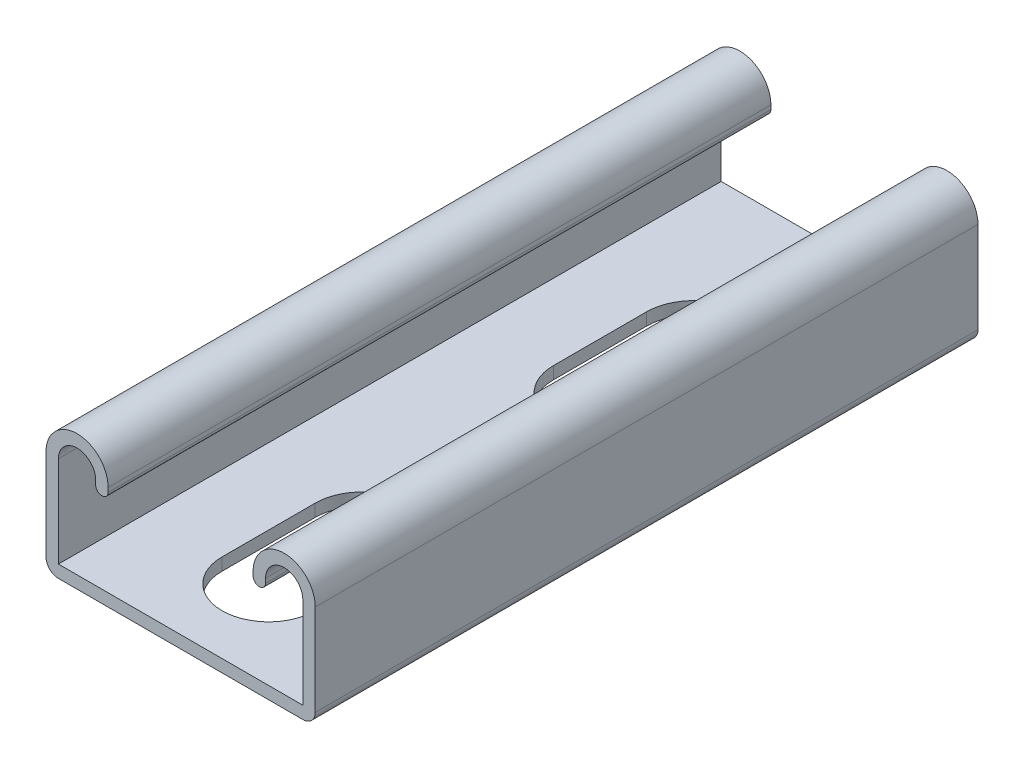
ISO-10303-21;
HEADER;
FILE_DESCRIPTION(('STEP AP214'),'2;1');
FILE_NAME('part.step','',(''),(''),'','','');
FILE_SCHEMA(('AUTOMOTIVE_DESIGN { 1 0 10303 214 1 1 1 1 }'));
ENDSEC;
DATA;
#1=APPLICATION_CONTEXT('core data for automotive mechanical design processes');
#2=APPLICATION_PROTOCOL_DEFINITION('international standard','automotive_design',2000,#1);
#3=PRODUCT_CONTEXT('',#1,'mechanical');
#4=PRODUCT('Part','Part','',(#3));
#5=PRODUCT_RELATED_PRODUCT_CATEGORY('part','',(#4));
#6=PRODUCT_DEFINITION_FORMATION('','',#4);
#7=PRODUCT_DEFINITION_CONTEXT('part definition',#1,'design');
#8=PRODUCT_DEFINITION('design','',#6,#7);
#9=PRODUCT_DEFINITION_SHAPE('','',#8);
#10=(LENGTH_UNIT() NAMED_UNIT(*) SI_UNIT(.MILLI.,.METRE.));
#11=(NAMED_UNIT(*) PLANE_ANGLE_UNIT() SI_UNIT($,.RADIAN.));
#12=(NAMED_UNIT(*) SI_UNIT($,.STERADIAN.) SOLID_ANGLE_UNIT());
#13=UNCERTAINTY_MEASURE_WITH_UNIT(LENGTH_MEASURE(1.E-05),#10,'distance_accuracy_value','');
#14=(GEOMETRIC_REPRESENTATION_CONTEXT(3) GLOBAL_UNCERTAINTY_ASSIGNED_CONTEXT((#13)) GLOBAL_UNIT_ASSIGNED_CONTEXT((#10,
#11,#12)) REPRESENTATION_CONTEXT('',''));
#15=CARTESIAN_POINT('',(0.,0.,0.));
#16=DIRECTION('',(0.,0.,1.));
#17=DIRECTION('',(1.,0.,0.));
#18=AXIS2_PLACEMENT_3D('',#15,#16,#17);
#19=CARTESIAN_POINT('',(-15.875,7.4295,101.6));
#20=DIRECTION('',(0.,0.,-1.));
#21=DIRECTION('',(-1.,0.,0.));
#22=AXIS2_PLACEMENT_3D('',#19,#20,#21);
#23=CYLINDRICAL_SURFACE('',#22,4.7625);
#24=CARTESIAN_POINT('',(-15.875,7.4295,0.));
#25=DIRECTION('',(0.,0.,1.));
#26=DIRECTION('',(-1.,0.,0.));
#27=AXIS2_PLACEMENT_3D('',#24,#25,#26);
#28=CIRCLE('',#27,4.7625);
#29=CARTESIAN_POINT('',(-11.1125,7.4295,0.));
#30=VERTEX_POINT('',#29);
#31=CARTESIAN_POINT('',(-20.6375,7.4295,0.));
#32=VERTEX_POINT('',#31);
#33=EDGE_CURVE('E254',#30,#32,#28,.T.);
#34=ORIENTED_EDGE('',*,*,#33,.T.);
#35=DIRECTION('',(0.,0.,-1.));
#36=VECTOR('',#35,1.);
#37=CARTESIAN_POINT('',(-20.6375,7.4295,101.6));
#38=LINE('',#37,#36);
#39=CARTESIAN_POINT('',(-20.6375,7.4295,101.6));
#40=VERTEX_POINT('',#39);
#41=EDGE_CURVE('E385',#40,#32,#38,.T.);
#42=ORIENTED_EDGE('',*,*,#41,.F.);
#43=CARTESIAN_POINT('',(-15.875,7.4295,101.6));
#44=DIRECTION('',(0.,0.,1.));
#45=DIRECTION('',(-1.,0.,0.));
#46=AXIS2_PLACEMENT_3D('',#43,#44,#45);
#47=CIRCLE('',#46,4.7625);
#48=CARTESIAN_POINT('',(-11.1125,7.4295,101.6));
#49=VERTEX_POINT('',#48);
#50=EDGE_CURVE('E261',#49,#40,#47,.T.);
#51=ORIENTED_EDGE('',*,*,#50,.F.);
#52=DIRECTION('',(0.,0.,-1.));
#53=VECTOR('',#52,1.);
#54=CARTESIAN_POINT('',(-11.1125,7.4295,101.6));
#55=LINE('',#54,#53);
#56=EDGE_CURVE('E299',#49,#30,#55,.T.);
#57=ORIENTED_EDGE('',*,*,#56,.T.);
#58=EDGE_LOOP('',(#34,#42,#51,#57));
#59=FACE_BOUND('',#58,.T.);
#60=ADVANCED_FACE('F33',(#59),#23,.T.);
#61=CARTESIAN_POINT('',(-20.6375,7.4295,101.6));
#62=DIRECTION('',(1.,0.,0.));
#63=DIRECTION('',(0.,0.,-1.));
#64=AXIS2_PLACEMENT_3D('',#61,#62,#63);
#65=PLANE('',#64);
#66=DIRECTION('',(0.,-1.,0.));
#67=VECTOR('',#66,1.);
#68=CARTESIAN_POINT('',(-20.6375,7.4295,0.));
#69=LINE('',#68,#67);
#70=CARTESIAN_POINT('',(-20.6375,-6.5532,0.));
#71=VERTEX_POINT('',#70);
#72=EDGE_CURVE('E302',#32,#71,#69,.T.);
#73=ORIENTED_EDGE('',*,*,#72,.T.);
#74=DIRECTION('',(0.,0.,-1.));
#75=VECTOR('',#74,1.);
#76=CARTESIAN_POINT('',(-20.6375,-6.5532,101.6));
#77=LINE('',#76,#75);
#78=CARTESIAN_POINT('',(-20.6375,-6.5532,101.6));
#79=VERTEX_POINT('',#78);
#80=EDGE_CURVE('E382',#79,#71,#77,.T.);
#81=ORIENTED_EDGE('',*,*,#80,.F.);
#82=DIRECTION('',(0.,-1.,0.));
#83=VECTOR('',#82,1.);
#84=CARTESIAN_POINT('',(-20.6375,7.4295,101.6));
#85=LINE('',#84,#83);
#86=EDGE_CURVE('E264',#40,#79,#85,.T.);
#87=ORIENTED_EDGE('',*,*,#86,.F.);
#88=ORIENTED_EDGE('',*,*,#41,.T.);
#89=EDGE_LOOP('',(#73,#81,#87,#88));
#90=FACE_BOUND('',#89,.T.);
#91=ADVANCED_FACE('F426',(#90),#65,.F.);
#92=CARTESIAN_POINT('',(-18.7325,-6.5532,101.6));
#93=DIRECTION('',(0.,0.,-1.));
#94=DIRECTION('',(-1.,0.,0.));
#95=AXIS2_PLACEMENT_3D('',#92,#93,#94);
#96=CYLINDRICAL_SURFACE('',#95,1.905);
#97=CARTESIAN_POINT('',(-18.7325,-6.5532,0.));
#98=DIRECTION('',(0.,0.,1.));
#99=DIRECTION('',(-1.,0.,0.));
#100=AXIS2_PLACEMENT_3D('',#97,#98,#99);
#101=CIRCLE('',#100,1.905);
#102=CARTESIAN_POINT('',(-18.7325,-8.4582,0.));
#103=VERTEX_POINT('',#102);
#104=EDGE_CURVE('E304',#71,#103,#101,.T.);
#105=ORIENTED_EDGE('',*,*,#104,.T.);
#106=DIRECTION('',(0.,0.,-1.));
#107=VECTOR('',#106,1.);
#108=CARTESIAN_POINT('',(-18.7325,-8.4582,101.6));
#109=LINE('',#108,#107);
#110=CARTESIAN_POINT('',(-18.7325,-8.4582,101.6));
#111=VERTEX_POINT('',#110);
#112=EDGE_CURVE('E379',#111,#103,#109,.T.);
#113=ORIENTED_EDGE('',*,*,#112,.F.);
#114=CARTESIAN_POINT('',(-18.7325,-6.5532,101.6));
#115=DIRECTION('',(0.,0.,1.));
#116=DIRECTION('',(-1.,0.,0.));
#117=AXIS2_PLACEMENT_3D('',#114,#115,#116);
#118=CIRCLE('',#117,1.905);
#119=EDGE_CURVE('E267',#79,#111,#118,.T.);
#120=ORIENTED_EDGE('',*,*,#119,.F.);
#121=ORIENTED_EDGE('',*,*,#80,.T.);
#122=EDGE_LOOP('',(#105,#113,#120,#121));
#123=FACE_BOUND('',#122,.T.);
#124=ADVANCED_FACE('F431',(#123),#96,.T.);
#125=CARTESIAN_POINT('',(-18.7325,-8.4582,101.6));
#126=DIRECTION('',(0.,1.,0.));
#127=DIRECTION('',(0.,0.,1.));
#128=AXIS2_PLACEMENT_3D('',#125,#126,#127);
#129=PLANE('',#128);
#130=DIRECTION('',(0.,0.,-1.));
#131=VECTOR('',#130,1.);
#132=CARTESIAN_POINT('',(-7.14375,-8.45820000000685,73.81875));
#133=LINE('',#132,#131);
#134=CARTESIAN_POINT('',(-7.14375,-8.4582,88.10625));
#135=VERTEX_POINT('',#134);
#136=CARTESIAN_POINT('',(-7.14375,-8.45820000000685,73.81875));
#137=VERTEX_POINT('',#136);
#138=EDGE_CURVE('E207',#135,#137,#133,.T.);
#139=ORIENTED_EDGE('',*,*,#138,.F.);
#140=CARTESIAN_POINT('',(0.,-8.45820000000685,88.10625));
#141=DIRECTION('',(0.,-1.,0.));
#142=DIRECTION('',(0.,0.,-1.));
#143=AXIS2_PLACEMENT_3D('',#140,#141,#142);
#144=CIRCLE('',#143,7.14375);
#145=CARTESIAN_POINT('',(7.14375,-8.45820000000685,88.10625));
#146=VERTEX_POINT('',#145);
#147=EDGE_CURVE('E47',#146,#135,#144,.T.);
#148=ORIENTED_EDGE('',*,*,#147,.F.);
#149=DIRECTION('',(0.,0.,1.));
#150=VECTOR('',#149,1.);
#151=CARTESIAN_POINT('',(7.14375,-8.45820000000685,88.10625));
#152=LINE('',#151,#150);
#153=CARTESIAN_POINT('',(7.14375,-8.45820000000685,73.81875));
#154=VERTEX_POINT('',#153);
#155=EDGE_CURVE('E223',#154,#146,#152,.T.);
#156=ORIENTED_EDGE('',*,*,#155,.F.);
#157=CARTESIAN_POINT('',(0.,-8.45820000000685,73.81875));
#158=DIRECTION('',(0.,-1.,0.));
#159=DIRECTION('',(0.,0.,-1.));
#160=AXIS2_PLACEMENT_3D('',#157,#158,#159);
#161=CIRCLE('',#160,7.14375);
#162=EDGE_CURVE('E217',#137,#154,#161,.T.);
#163=ORIENTED_EDGE('',*,*,#162,.F.);
#164=EDGE_LOOP('',(#139,#148,#156,#163));
#165=FACE_BOUND('',#164,.T.);
#166=DIRECTION('',(0.,0.,-1.));
#167=VECTOR('',#166,1.);
#168=CARTESIAN_POINT('',(-7.14375,-8.45820000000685,23.01875));
#169=LINE('',#168,#167);
#170=CARTESIAN_POINT('',(-7.14375,-8.4582,37.30625));
#171=VERTEX_POINT('',#170);
#172=CARTESIAN_POINT('',(-7.14375,-8.45820000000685,23.01875));
#173=VERTEX_POINT('',#172);
#174=EDGE_CURVE('E242',#171,#173,#169,.T.);
#175=ORIENTED_EDGE('',*,*,#174,.F.);
#176=CARTESIAN_POINT('',(0.,-8.45820000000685,37.30625));
#177=DIRECTION('',(0.,-1.,0.));
#178=DIRECTION('',(0.,0.,-1.));
#179=AXIS2_PLACEMENT_3D('',#176,#177,#178);
#180=CIRCLE('',#179,7.14375);
#181=CARTESIAN_POINT('',(7.14375,-8.45820000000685,37.30625));
#182=VERTEX_POINT('',#181);
#183=EDGE_CURVE('E240',#182,#171,#180,.T.);
#184=ORIENTED_EDGE('',*,*,#183,.F.);
#185=DIRECTION('',(0.,0.,1.));
#186=VECTOR('',#185,1.);
#187=CARTESIAN_POINT('',(7.14375,-8.45820000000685,37.30625));
#188=LINE('',#187,#186);
#189=CARTESIAN_POINT('',(7.14375,-8.45820000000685,23.01875));
#190=VERTEX_POINT('',#189);
#191=EDGE_CURVE('E248',#190,#182,#188,.T.);
#192=ORIENTED_EDGE('',*,*,#191,.F.);
#193=CARTESIAN_POINT('',(0.,-8.45820000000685,23.01875));
#194=DIRECTION('',(0.,-1.,0.));
#195=DIRECTION('',(0.,0.,-1.));
#196=AXIS2_PLACEMENT_3D('',#193,#194,#195);
#197=CIRCLE('',#196,7.14375);
#198=EDGE_CURVE('E245',#173,#190,#197,.T.);
#199=ORIENTED_EDGE('',*,*,#198,.F.);
#200=EDGE_LOOP('',(#175,#184,#192,#199));
#201=FACE_BOUND('',#200,.T.);
#202=DIRECTION('',(1.,0.,0.));
#203=VECTOR('',#202,1.);
#204=CARTESIAN_POINT('',(-18.7325,-8.4582,0.));
#205=LINE('',#204,#203);
#206=CARTESIAN_POINT('',(18.7325,-8.4582,0.));
#207=VERTEX_POINT('',#206);
#208=EDGE_CURVE('E306',#103,#207,#205,.T.);
#209=ORIENTED_EDGE('',*,*,#208,.T.);
#210=DIRECTION('',(0.,0.,-1.));
#211=VECTOR('',#210,1.);
#212=CARTESIAN_POINT('',(18.7325,-8.4582,101.6));
#213=LINE('',#212,#211);
#214=CARTESIAN_POINT('',(18.7325,-8.4582,101.6));
#215=VERTEX_POINT('',#214);
#216=EDGE_CURVE('E376',#215,#207,#213,.T.);
#217=ORIENTED_EDGE('',*,*,#216,.F.);
#218=DIRECTION('',(1.,0.,0.));
#219=VECTOR('',#218,1.);
#220=CARTESIAN_POINT('',(-18.7325,-8.4582,101.6));
#221=LINE('',#220,#219);
#222=EDGE_CURVE('E269',#111,#215,#221,.T.);
#223=ORIENTED_EDGE('',*,*,#222,.F.);
#224=ORIENTED_EDGE('',*,*,#112,.T.);
#225=EDGE_LOOP('',(#209,#217,#223,#224));
#226=FACE_BOUND('',#225,.T.);
#227=ADVANCED_FACE('F221',(#165,#201,#226),#129,.F.);
#228=CARTESIAN_POINT('',(18.7325,-6.5532,101.6));
#229=DIRECTION('',(0.,0.,-1.));
#230=DIRECTION('',(-1.,0.,0.));
#231=AXIS2_PLACEMENT_3D('',#228,#229,#230);
#232=CYLINDRICAL_SURFACE('',#231,1.905);
#233=CARTESIAN_POINT('',(18.7325,-6.5532,0.));
#234=DIRECTION('',(0.,0.,1.));
#235=DIRECTION('',(1.,0.,0.));
#236=AXIS2_PLACEMENT_3D('',#233,#234,#235);
#237=CIRCLE('',#236,1.905);
#238=CARTESIAN_POINT('',(20.6375,-6.5532,0.));
#239=VERTEX_POINT('',#238);
#240=EDGE_CURVE('E308',#207,#239,#237,.T.);
#241=ORIENTED_EDGE('',*,*,#240,.T.);
#242=DIRECTION('',(0.,0.,-1.));
#243=VECTOR('',#242,1.);
#244=CARTESIAN_POINT('',(20.6375,-6.5532,101.6));
#245=LINE('',#244,#243);
#246=CARTESIAN_POINT('',(20.6375,-6.5532,101.6));
#247=VERTEX_POINT('',#246);
#248=EDGE_CURVE('E373',#247,#239,#245,.T.);
#249=ORIENTED_EDGE('',*,*,#248,.F.);
#250=CARTESIAN_POINT('',(18.7325,-6.5532,101.6));
#251=DIRECTION('',(0.,0.,1.));
#252=DIRECTION('',(1.,0.,0.));
#253=AXIS2_PLACEMENT_3D('',#250,#251,#252);
#254=CIRCLE('',#253,1.905);
#255=EDGE_CURVE('E271',#215,#247,#254,.T.);
#256=ORIENTED_EDGE('',*,*,#255,.F.);
#257=ORIENTED_EDGE('',*,*,#216,.T.);
#258=EDGE_LOOP('',(#241,#249,#256,#257));
#259=FACE_BOUND('',#258,.T.);
#260=ADVANCED_FACE('F511',(#259),#232,.T.);
#261=CARTESIAN_POINT('',(20.6375,-6.5532,101.6));
#262=DIRECTION('',(-1.,0.,0.));
#263=DIRECTION('',(0.,-1.,0.));
#264=AXIS2_PLACEMENT_3D('',#261,#262,#263);
#265=PLANE('',#264);
#266=DIRECTION('',(0.,1.,0.));
#267=VECTOR('',#266,1.);
#268=CARTESIAN_POINT('',(20.6375,-6.5532,0.));
#269=LINE('',#268,#267);
#270=CARTESIAN_POINT('',(20.6375,7.4295,0.));
#271=VERTEX_POINT('',#270);
#272=EDGE_CURVE('E310',#239,#271,#269,.T.);
#273=ORIENTED_EDGE('',*,*,#272,.T.);
#274=DIRECTION('',(0.,0.,-1.));
#275=VECTOR('',#274,1.);
#276=CARTESIAN_POINT('',(20.6375,7.4295,101.6));
#277=LINE('',#276,#275);
#278=CARTESIAN_POINT('',(20.6375,7.4295,101.6));
#279=VERTEX_POINT('',#278);
#280=EDGE_CURVE('E370',#279,#271,#277,.T.);
#281=ORIENTED_EDGE('',*,*,#280,.F.);
#282=DIRECTION('',(0.,1.,0.));
#283=VECTOR('',#282,1.);
#284=CARTESIAN_POINT('',(20.6375,-6.5532,101.6));
#285=LINE('',#284,#283);
#286=EDGE_CURVE('E273',#247,#279,#285,.T.);
#287=ORIENTED_EDGE('',*,*,#286,.F.);
#288=ORIENTED_EDGE('',*,*,#248,.T.);
#289=EDGE_LOOP('',(#273,#281,#287,#288));
#290=FACE_BOUND('',#289,.T.);
#291=ADVANCED_FACE('F507',(#290),#265,.F.);
#292=CARTESIAN_POINT('',(15.875,7.4295,101.6));
#293=DIRECTION('',(0.,0.,-1.));
#294=DIRECTION('',(-1.,0.,0.));
#295=AXIS2_PLACEMENT_3D('',#292,#293,#294);
#296=CYLINDRICAL_SURFACE('',#295,4.7625);
#297=CARTESIAN_POINT('',(15.875,7.4295,0.));
#298=DIRECTION('',(0.,0.,1.));
#299=DIRECTION('',(1.,0.,0.));
#300=AXIS2_PLACEMENT_3D('',#297,#298,#299);
#301=CIRCLE('',#300,4.7625);
#302=CARTESIAN_POINT('',(11.1125,7.4295,0.));
#303=VERTEX_POINT('',#302);
#304=EDGE_CURVE('E312',#271,#303,#301,.T.);
#305=ORIENTED_EDGE('',*,*,#304,.T.);
#306=DIRECTION('',(0.,0.,-1.));
#307=VECTOR('',#306,1.);
#308=CARTESIAN_POINT('',(11.1125,7.4295,101.6));
#309=LINE('',#308,#307);
#310=CARTESIAN_POINT('',(11.1125,7.4295,101.6));
#311=VERTEX_POINT('',#310);
#312=EDGE_CURVE('E367',#311,#303,#309,.T.);
#313=ORIENTED_EDGE('',*,*,#312,.F.);
#314=CARTESIAN_POINT('',(15.875,7.4295,101.6));
#315=DIRECTION('',(0.,0.,1.));
#316=DIRECTION('',(1.,0.,0.));
#317=AXIS2_PLACEMENT_3D('',#314,#315,#316);
#318=CIRCLE('',#317,4.7625);
#319=EDGE_CURVE('E275',#279,#311,#318,.T.);
#320=ORIENTED_EDGE('',*,*,#319,.F.);
#321=ORIENTED_EDGE('',*,*,#280,.T.);
#322=EDGE_LOOP('',(#305,#313,#320,#321));
#323=FACE_BOUND('',#322,.T.);
#324=ADVANCED_FACE('F502',(#323),#296,.T.);
#325=CARTESIAN_POINT('',(11.1125,7.4295,101.6));
#326=DIRECTION('',(1.,0.,0.));
#327=DIRECTION('',(0.,1.,0.));
#328=AXIS2_PLACEMENT_3D('',#325,#326,#327);
#329=PLANE('',#328);
#330=DIRECTION('',(0.,-1.,0.));
#331=VECTOR('',#330,1.);
#332=CARTESIAN_POINT('',(11.1125,7.4295,0.));
#333=LINE('',#332,#331);
#334=CARTESIAN_POINT('',(11.1125,6.7945,0.));
#335=VERTEX_POINT('',#334);
#336=EDGE_CURVE('E314',#303,#335,#333,.T.);
#337=ORIENTED_EDGE('',*,*,#336,.T.);
#338=DIRECTION('',(0.,0.,-1.));
#339=VECTOR('',#338,1.);
#340=CARTESIAN_POINT('',(11.1125,6.7945,101.6));
#341=LINE('',#340,#339);
#342=CARTESIAN_POINT('',(11.1125,6.7945,101.6));
#343=VERTEX_POINT('',#342);
#344=EDGE_CURVE('E364',#343,#335,#341,.T.);
#345=ORIENTED_EDGE('',*,*,#344,.F.);
#346=DIRECTION('',(0.,-1.,0.));
#347=VECTOR('',#346,1.);
#348=CARTESIAN_POINT('',(11.1125,7.4295,101.6));
#349=LINE('',#348,#347);
#350=EDGE_CURVE('E277',#311,#343,#349,.T.);
#351=ORIENTED_EDGE('',*,*,#350,.F.);
#352=ORIENTED_EDGE('',*,*,#312,.T.);
#353=EDGE_LOOP('',(#337,#345,#351,#352));
#354=FACE_BOUND('',#353,.T.);
#355=ADVANCED_FACE('F496',(#354),#329,.F.);
#356=CARTESIAN_POINT('',(12.065,6.7945,101.6));
#357=DIRECTION('',(0.,0.,-1.));
#358=DIRECTION('',(-1.,0.,0.));
#359=AXIS2_PLACEMENT_3D('',#356,#357,#358);
#360=CYLINDRICAL_SURFACE('',#359,0.952500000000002);
#361=CARTESIAN_POINT('',(12.065,6.7945,0.));
#362=DIRECTION('',(0.,0.,1.));
#363=DIRECTION('',(1.,0.,0.));
#364=AXIS2_PLACEMENT_3D('',#361,#362,#363);
#365=CIRCLE('',#364,0.952500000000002);
#366=CARTESIAN_POINT('',(13.0175,6.7945,0.));
#367=VERTEX_POINT('',#366);
#368=EDGE_CURVE('E316',#335,#367,#365,.T.);
#369=ORIENTED_EDGE('',*,*,#368,.T.);
#370=DIRECTION('',(0.,0.,-1.));
#371=VECTOR('',#370,1.);
#372=CARTESIAN_POINT('',(13.0175,6.7945,101.6));
#373=LINE('',#372,#371);
#374=CARTESIAN_POINT('',(13.0175,6.7945,101.6));
#375=VERTEX_POINT('',#374);
#376=EDGE_CURVE('E361',#375,#367,#373,.T.);
#377=ORIENTED_EDGE('',*,*,#376,.F.);
#378=CARTESIAN_POINT('',(12.065,6.7945,101.6));
#379=DIRECTION('',(0.,0.,1.));
#380=DIRECTION('',(1.,0.,0.));
#381=AXIS2_PLACEMENT_3D('',#378,#379,#380);
#382=CIRCLE('',#381,0.952500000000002);
#383=EDGE_CURVE('E279',#343,#375,#382,.T.);
#384=ORIENTED_EDGE('',*,*,#383,.F.);
#385=ORIENTED_EDGE('',*,*,#344,.T.);
#386=EDGE_LOOP('',(#369,#377,#384,#385));
#387=FACE_BOUND('',#386,.T.);
#388=ADVANCED_FACE('F492',(#387),#360,.T.);
#389=CARTESIAN_POINT('',(13.0175,7.4295,101.6));
#390=DIRECTION('',(-1.,0.,0.));
#391=DIRECTION('',(0.,-1.,0.));
#392=AXIS2_PLACEMENT_3D('',#389,#390,#391);
#393=PLANE('',#392);
#394=DIRECTION('',(0.,1.,0.));
#395=VECTOR('',#394,1.);
#396=CARTESIAN_POINT('',(13.0175,7.4295,0.));
#397=LINE('',#396,#395);
#398=CARTESIAN_POINT('',(13.0175,7.4295,0.));
#399=VERTEX_POINT('',#398);
#400=EDGE_CURVE('E318',#367,#399,#397,.T.);
#401=ORIENTED_EDGE('',*,*,#400,.T.);
#402=DIRECTION('',(0.,0.,-1.));
#403=VECTOR('',#402,1.);
#404=CARTESIAN_POINT('',(13.0175,7.4295,101.6));
#405=LINE('',#404,#403);
#406=CARTESIAN_POINT('',(13.0175,7.4295,101.6));
#407=VERTEX_POINT('',#406);
#408=EDGE_CURVE('E358',#407,#399,#405,.T.);
#409=ORIENTED_EDGE('',*,*,#408,.F.);
#410=DIRECTION('',(0.,1.,0.));
#411=VECTOR('',#410,1.);
#412=CARTESIAN_POINT('',(13.0175,7.4295,101.6));
#413=LINE('',#412,#411);
#414=EDGE_CURVE('E281',#375,#407,#413,.T.);
#415=ORIENTED_EDGE('',*,*,#414,.F.);
#416=ORIENTED_EDGE('',*,*,#376,.T.);
#417=EDGE_LOOP('',(#401,#409,#415,#416));
#418=FACE_BOUND('',#417,.T.);
#419=ADVANCED_FACE('F487',(#418),#393,.F.);
#420=CARTESIAN_POINT('',(15.875,7.4295,101.6));
#421=DIRECTION('',(0.,0.,-1.));
#422=DIRECTION('',(-1.,0.,0.));
#423=AXIS2_PLACEMENT_3D('',#420,#421,#422);
#424=CYLINDRICAL_SURFACE('',#423,2.8575);
#425=CARTESIAN_POINT('',(15.875,7.4295,0.));
#426=DIRECTION('',(0.,0.,-1.));
#427=DIRECTION('',(1.,0.,0.));
#428=AXIS2_PLACEMENT_3D('',#425,#426,#427);
#429=CIRCLE('',#428,2.8575);
#430=CARTESIAN_POINT('',(18.7325,7.4295,0.));
#431=VERTEX_POINT('',#430);
#432=EDGE_CURVE('E320',#399,#431,#429,.T.);
#433=ORIENTED_EDGE('',*,*,#432,.T.);
#434=DIRECTION('',(0.,0.,-1.));
#435=VECTOR('',#434,1.);
#436=CARTESIAN_POINT('',(18.7325,7.4295,101.6));
#437=LINE('',#436,#435);
#438=CARTESIAN_POINT('',(18.7325,7.4295,101.6));
#439=VERTEX_POINT('',#438);
#440=EDGE_CURVE('E355',#439,#431,#437,.T.);
#441=ORIENTED_EDGE('',*,*,#440,.F.);
#442=CARTESIAN_POINT('',(15.875,7.4295,101.6));
#443=DIRECTION('',(0.,0.,-1.));
#444=DIRECTION('',(1.,0.,0.));
#445=AXIS2_PLACEMENT_3D('',#442,#443,#444);
#446=CIRCLE('',#445,2.8575);
#447=EDGE_CURVE('E283',#407,#439,#446,.T.);
#448=ORIENTED_EDGE('',*,*,#447,.F.);
#449=ORIENTED_EDGE('',*,*,#408,.T.);
#450=EDGE_LOOP('',(#433,#441,#448,#449));
#451=FACE_BOUND('',#450,.T.);
#452=ADVANCED_FACE('F481',(#451),#424,.F.);
#453=CARTESIAN_POINT('',(18.7325,-6.5532,101.6));
#454=DIRECTION('',(1.,0.,0.));
#455=DIRECTION('',(0.,1.,0.));
#456=AXIS2_PLACEMENT_3D('',#453,#454,#455);
#457=PLANE('',#456);
#458=DIRECTION('',(0.,-1.,0.));
#459=VECTOR('',#458,1.);
#460=CARTESIAN_POINT('',(18.7325,-6.5532,0.));
#461=LINE('',#460,#459);
#462=CARTESIAN_POINT('',(18.7325,-6.5532,0.));
#463=VERTEX_POINT('',#462);
#464=EDGE_CURVE('E322',#431,#463,#461,.T.);
#465=ORIENTED_EDGE('',*,*,#464,.T.);
#466=DIRECTION('',(0.,0.,-1.));
#467=VECTOR('',#466,1.);
#468=CARTESIAN_POINT('',(18.7325,-6.5532,101.6));
#469=LINE('',#468,#467);
#470=CARTESIAN_POINT('',(18.7325,-6.5532,101.6));
#471=VERTEX_POINT('',#470);
#472=EDGE_CURVE('E352',#471,#463,#469,.T.);
#473=ORIENTED_EDGE('',*,*,#472,.F.);
#474=DIRECTION('',(0.,-1.,0.));
#475=VECTOR('',#474,1.);
#476=CARTESIAN_POINT('',(18.7325,-6.5532,101.6));
#477=LINE('',#476,#475);
#478=EDGE_CURVE('E285',#439,#471,#477,.T.);
#479=ORIENTED_EDGE('',*,*,#478,.F.);
#480=ORIENTED_EDGE('',*,*,#440,.T.);
#481=EDGE_LOOP('',(#465,#473,#479,#480));
#482=FACE_BOUND('',#481,.T.);
#483=ADVANCED_FACE('F477',(#482),#457,.F.);
#484=CARTESIAN_POINT('',(-18.7325,-6.5532,101.6));
#485=DIRECTION('',(0.,-1.,0.));
#486=DIRECTION('',(0.,0.,-1.));
#487=AXIS2_PLACEMENT_3D('',#484,#485,#486);
#488=PLANE('',#487);
#489=DIRECTION('',(0.,0.,1.));
#490=VECTOR('',#489,1.);
#491=CARTESIAN_POINT('',(7.14375,-6.5532,152.4));
#492=LINE('',#491,#490);
#493=CARTESIAN_POINT('',(7.14375,-6.5532,73.81875));
#494=VERTEX_POINT('',#493);
#495=CARTESIAN_POINT('',(7.14375,-6.5532,88.10625));
#496=VERTEX_POINT('',#495);
#497=EDGE_CURVE('E233',#494,#496,#492,.T.);
#498=ORIENTED_EDGE('',*,*,#497,.T.);
#499=CARTESIAN_POINT('',(0.,-6.5532,88.10625));
#500=DIRECTION('',(0.,-1.,0.));
#501=DIRECTION('',(0.,0.,-1.));
#502=AXIS2_PLACEMENT_3D('',#499,#500,#501);
#503=CIRCLE('',#502,7.14375);
#504=CARTESIAN_POINT('',(-7.14375,-6.5532,88.10625));
#505=VERTEX_POINT('',#504);
#506=EDGE_CURVE('E237',#496,#505,#503,.T.);
#507=ORIENTED_EDGE('',*,*,#506,.T.);
#508=DIRECTION('',(0.,0.,-1.));
#509=VECTOR('',#508,1.);
#510=CARTESIAN_POINT('',(-7.14375,-6.5532,152.4));
#511=LINE('',#510,#509);
#512=CARTESIAN_POINT('',(-7.14375,-6.5532,73.81875));
#513=VERTEX_POINT('',#512);
#514=EDGE_CURVE('E214',#505,#513,#511,.T.);
#515=ORIENTED_EDGE('',*,*,#514,.T.);
#516=CARTESIAN_POINT('',(0.,-6.5532,73.81875));
#517=DIRECTION('',(0.,-1.,0.));
#518=DIRECTION('',(0.,0.,-1.));
#519=AXIS2_PLACEMENT_3D('',#516,#517,#518);
#520=CIRCLE('',#519,7.14375);
#521=EDGE_CURVE('E55',#513,#494,#520,.T.);
#522=ORIENTED_EDGE('',*,*,#521,.T.);
#523=EDGE_LOOP('',(#498,#507,#515,#522));
#524=FACE_BOUND('',#523,.T.);
#525=DIRECTION('',(0.,0.,1.));
#526=VECTOR('',#525,1.);
#527=CARTESIAN_POINT('',(7.14375,-6.5532,101.6));
#528=LINE('',#527,#526);
#529=CARTESIAN_POINT('',(7.14375,-6.5532,23.01875));
#530=VERTEX_POINT('',#529);
#531=CARTESIAN_POINT('',(7.14375,-6.5532,37.30625));
#532=VERTEX_POINT('',#531);
#533=EDGE_CURVE('E40',#530,#532,#528,.T.);
#534=ORIENTED_EDGE('',*,*,#533,.T.);
#535=CARTESIAN_POINT('',(0.,-6.5532,37.30625));
#536=DIRECTION('',(0.,-1.,0.));
#537=DIRECTION('',(0.,0.,-1.));
#538=AXIS2_PLACEMENT_3D('',#535,#536,#537);
#539=CIRCLE('',#538,7.14375);
#540=CARTESIAN_POINT('',(-7.14375,-6.5532,37.30625));
#541=VERTEX_POINT('',#540);
#542=EDGE_CURVE('E11',#532,#541,#539,.T.);
#543=ORIENTED_EDGE('',*,*,#542,.T.);
#544=DIRECTION('',(0.,0.,-1.));
#545=VECTOR('',#544,1.);
#546=CARTESIAN_POINT('',(-7.14375,-6.5532,101.6));
#547=LINE('',#546,#545);
#548=CARTESIAN_POINT('',(-7.14375,-6.5532,23.01875));
#549=VERTEX_POINT('',#548);
#550=EDGE_CURVE('E388',#541,#549,#547,.T.);
#551=ORIENTED_EDGE('',*,*,#550,.T.);
#552=CARTESIAN_POINT('',(0.,-6.5532,23.01875));
#553=DIRECTION('',(0.,-1.,0.));
#554=DIRECTION('',(0.,0.,-1.));
#555=AXIS2_PLACEMENT_3D('',#552,#553,#554);
#556=CIRCLE('',#555,7.14375);
#557=EDGE_CURVE('E391',#549,#530,#556,.T.);
#558=ORIENTED_EDGE('',*,*,#557,.T.);
#559=EDGE_LOOP('',(#534,#543,#551,#558));
#560=FACE_BOUND('',#559,.T.);
#561=DIRECTION('',(-1.,0.,0.));
#562=VECTOR('',#561,1.);
#563=CARTESIAN_POINT('',(-18.7325,-6.5532,0.));
#564=LINE('',#563,#562);
#565=CARTESIAN_POINT('',(-18.7325,-6.5532,0.));
#566=VERTEX_POINT('',#565);
#567=EDGE_CURVE('E324',#463,#566,#564,.T.);
#568=ORIENTED_EDGE('',*,*,#567,.T.);
#569=DIRECTION('',(0.,0.,-1.));
#570=VECTOR('',#569,1.);
#571=CARTESIAN_POINT('',(-18.7325,-6.5532,101.6));
#572=LINE('',#571,#570);
#573=CARTESIAN_POINT('',(-18.7325,-6.5532,101.6));
#574=VERTEX_POINT('',#573);
#575=EDGE_CURVE('E349',#574,#566,#572,.T.);
#576=ORIENTED_EDGE('',*,*,#575,.F.);
#577=DIRECTION('',(-1.,0.,0.));
#578=VECTOR('',#577,1.);
#579=CARTESIAN_POINT('',(-18.7325,-6.5532,101.6));
#580=LINE('',#579,#578);
#581=EDGE_CURVE('E287',#471,#574,#580,.T.);
#582=ORIENTED_EDGE('',*,*,#581,.F.);
#583=ORIENTED_EDGE('',*,*,#472,.T.);
#584=EDGE_LOOP('',(#568,#576,#582,#583));
#585=FACE_BOUND('',#584,.T.);
#586=ADVANCED_FACE('F395',(#524,#560,#585),#488,.F.);
#587=CARTESIAN_POINT('',(-18.7325,7.4295,101.6));
#588=DIRECTION('',(-1.,0.,0.));
#589=DIRECTION('',(0.,0.,1.));
#590=AXIS2_PLACEMENT_3D('',#587,#588,#589);
#591=PLANE('',#590);
#592=DIRECTION('',(0.,1.,0.));
#593=VECTOR('',#592,1.);
#594=CARTESIAN_POINT('',(-18.7325,7.4295,0.));
#595=LINE('',#594,#593);
#596=CARTESIAN_POINT('',(-18.7325,7.4295,0.));
#597=VERTEX_POINT('',#596);
#598=EDGE_CURVE('E326',#566,#597,#595,.T.);
#599=ORIENTED_EDGE('',*,*,#598,.T.);
#600=DIRECTION('',(0.,0.,-1.));
#601=VECTOR('',#600,1.);
#602=CARTESIAN_POINT('',(-18.7325,7.4295,101.6));
#603=LINE('',#602,#601);
#604=CARTESIAN_POINT('',(-18.7325,7.4295,101.6));
#605=VERTEX_POINT('',#604);
#606=EDGE_CURVE('E346',#605,#597,#603,.T.);
#607=ORIENTED_EDGE('',*,*,#606,.F.);
#608=DIRECTION('',(0.,1.,0.));
#609=VECTOR('',#608,1.);
#610=CARTESIAN_POINT('',(-18.7325,7.4295,101.6));
#611=LINE('',#610,#609);
#612=EDGE_CURVE('E289',#574,#605,#611,.T.);
#613=ORIENTED_EDGE('',*,*,#612,.F.);
#614=ORIENTED_EDGE('',*,*,#575,.T.);
#615=EDGE_LOOP('',(#599,#607,#613,#614));
#616=FACE_BOUND('',#615,.T.);
#617=ADVANCED_FACE('F468',(#616),#591,.F.);
#618=CARTESIAN_POINT('',(-15.875,7.4295,101.6));
#619=DIRECTION('',(0.,0.,-1.));
#620=DIRECTION('',(-1.,0.,0.));
#621=AXIS2_PLACEMENT_3D('',#618,#619,#620);
#622=CYLINDRICAL_SURFACE('',#621,2.8575);
#623=CARTESIAN_POINT('',(-15.875,7.4295,0.));
#624=DIRECTION('',(0.,0.,-1.));
#625=DIRECTION('',(-1.,0.,0.));
#626=AXIS2_PLACEMENT_3D('',#623,#624,#625);
#627=CIRCLE('',#626,2.8575);
#628=CARTESIAN_POINT('',(-13.0175,7.4295,0.));
#629=VERTEX_POINT('',#628);
#630=EDGE_CURVE('E328',#597,#629,#627,.T.);
#631=ORIENTED_EDGE('',*,*,#630,.T.);
#632=DIRECTION('',(0.,0.,-1.));
#633=VECTOR('',#632,1.);
#634=CARTESIAN_POINT('',(-13.0175,7.4295,101.6));
#635=LINE('',#634,#633);
#636=CARTESIAN_POINT('',(-13.0175,7.4295,101.6));
#637=VERTEX_POINT('',#636);
#638=EDGE_CURVE('E343',#637,#629,#635,.T.);
#639=ORIENTED_EDGE('',*,*,#638,.F.);
#640=CARTESIAN_POINT('',(-15.875,7.4295,101.6));
#641=DIRECTION('',(0.,0.,-1.));
#642=DIRECTION('',(-1.,0.,0.));
#643=AXIS2_PLACEMENT_3D('',#640,#641,#642);
#644=CIRCLE('',#643,2.8575);
#645=EDGE_CURVE('E291',#605,#637,#644,.T.);
#646=ORIENTED_EDGE('',*,*,#645,.F.);
#647=ORIENTED_EDGE('',*,*,#606,.T.);
#648=EDGE_LOOP('',(#631,#639,#646,#647));
#649=FACE_BOUND('',#648,.T.);
#650=ADVANCED_FACE('F464',(#649),#622,.F.);
#651=CARTESIAN_POINT('',(-13.0175,7.4295,101.6));
#652=DIRECTION('',(1.,0.,0.));
#653=DIRECTION('',(0.,1.,0.));
#654=AXIS2_PLACEMENT_3D('',#651,#652,#653);
#655=PLANE('',#654);
#656=DIRECTION('',(0.,-1.,0.));
#657=VECTOR('',#656,1.);
#658=CARTESIAN_POINT('',(-13.0175,7.4295,0.));
#659=LINE('',#658,#657);
#660=CARTESIAN_POINT('',(-13.0175,6.7945,0.));
#661=VERTEX_POINT('',#660);
#662=EDGE_CURVE('E330',#629,#661,#659,.T.);
#663=ORIENTED_EDGE('',*,*,#662,.T.);
#664=DIRECTION('',(0.,0.,-1.));
#665=VECTOR('',#664,1.);
#666=CARTESIAN_POINT('',(-13.0175,6.7945,101.6));
#667=LINE('',#666,#665);
#668=CARTESIAN_POINT('',(-13.0175,6.7945,101.6));
#669=VERTEX_POINT('',#668);
#670=EDGE_CURVE('E340',#669,#661,#667,.T.);
#671=ORIENTED_EDGE('',*,*,#670,.F.);
#672=DIRECTION('',(0.,-1.,0.));
#673=VECTOR('',#672,1.);
#674=CARTESIAN_POINT('',(-13.0175,7.4295,101.6));
#675=LINE('',#674,#673);
#676=EDGE_CURVE('E293',#637,#669,#675,.T.);
#677=ORIENTED_EDGE('',*,*,#676,.F.);
#678=ORIENTED_EDGE('',*,*,#638,.T.);
#679=EDGE_LOOP('',(#663,#671,#677,#678));
#680=FACE_BOUND('',#679,.T.);
#681=ADVANCED_FACE('F459',(#680),#655,.F.);
#682=CARTESIAN_POINT('',(-12.065,6.7945,101.6));
#683=DIRECTION('',(0.,0.,-1.));
#684=DIRECTION('',(-1.,0.,0.));
#685=AXIS2_PLACEMENT_3D('',#682,#683,#684);
#686=CYLINDRICAL_SURFACE('',#685,0.952499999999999);
#687=CARTESIAN_POINT('',(-12.065,6.7945,0.));
#688=DIRECTION('',(0.,0.,1.));
#689=DIRECTION('',(-1.,0.,0.));
#690=AXIS2_PLACEMENT_3D('',#687,#688,#689);
#691=CIRCLE('',#690,0.952499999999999);
#692=CARTESIAN_POINT('',(-11.1125,6.7945,0.));
#693=VERTEX_POINT('',#692);
#694=EDGE_CURVE('E332',#661,#693,#691,.T.);
#695=ORIENTED_EDGE('',*,*,#694,.T.);
#696=DIRECTION('',(0.,0.,-1.));
#697=VECTOR('',#696,1.);
#698=CARTESIAN_POINT('',(-11.1125,6.7945,101.6));
#699=LINE('',#698,#697);
#700=CARTESIAN_POINT('',(-11.1125,6.7945,101.6));
#701=VERTEX_POINT('',#700);
#702=EDGE_CURVE('E337',#701,#693,#699,.T.);
#703=ORIENTED_EDGE('',*,*,#702,.F.);
#704=CARTESIAN_POINT('',(-12.065,6.7945,101.6));
#705=DIRECTION('',(0.,0.,1.));
#706=DIRECTION('',(-1.,0.,0.));
#707=AXIS2_PLACEMENT_3D('',#704,#705,#706);
#708=CIRCLE('',#707,0.952499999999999);
#709=EDGE_CURVE('E295',#669,#701,#708,.T.);
#710=ORIENTED_EDGE('',*,*,#709,.F.);
#711=ORIENTED_EDGE('',*,*,#670,.T.);
#712=EDGE_LOOP('',(#695,#703,#710,#711));
#713=FACE_BOUND('',#712,.T.);
#714=ADVANCED_FACE('F453',(#713),#686,.T.);
#715=CARTESIAN_POINT('',(-11.1125,7.4295,101.6));
#716=DIRECTION('',(-1.,0.,0.));
#717=DIRECTION('',(0.,-1.,0.));
#718=AXIS2_PLACEMENT_3D('',#715,#716,#717);
#719=PLANE('',#718);
#720=DIRECTION('',(0.,1.,0.));
#721=VECTOR('',#720,1.);
#722=CARTESIAN_POINT('',(-11.1125,7.4295,0.));
#723=LINE('',#722,#721);
#724=EDGE_CURVE('E265',#693,#30,#723,.T.);
#725=ORIENTED_EDGE('',*,*,#724,.T.);
#726=ORIENTED_EDGE('',*,*,#56,.F.);
#727=DIRECTION('',(0.,1.,0.));
#728=VECTOR('',#727,1.);
#729=CARTESIAN_POINT('',(-11.1125,7.4295,101.6));
#730=LINE('',#729,#728);
#731=EDGE_CURVE('E297',#701,#49,#730,.T.);
#732=ORIENTED_EDGE('',*,*,#731,.F.);
#733=ORIENTED_EDGE('',*,*,#702,.T.);
#734=EDGE_LOOP('',(#725,#726,#732,#733));
#735=FACE_BOUND('',#734,.T.);
#736=ADVANCED_FACE('F451',(#735),#719,.F.);
#737=CARTESIAN_POINT('',(-15.875,7.4295,101.6));
#738=DIRECTION('',(0.,0.,-1.));
#739=DIRECTION('',(-1.,0.,0.));
#740=AXIS2_PLACEMENT_3D('',#737,#738,#739);
#741=PLANE('',#740);
#742=ORIENTED_EDGE('',*,*,#50,.T.);
#743=ORIENTED_EDGE('',*,*,#86,.T.);
#744=ORIENTED_EDGE('',*,*,#119,.T.);
#745=ORIENTED_EDGE('',*,*,#222,.T.);
#746=ORIENTED_EDGE('',*,*,#255,.T.);
#747=ORIENTED_EDGE('',*,*,#286,.T.);
#748=ORIENTED_EDGE('',*,*,#319,.T.);
#749=ORIENTED_EDGE('',*,*,#350,.T.);
#750=ORIENTED_EDGE('',*,*,#383,.T.);
#751=ORIENTED_EDGE('',*,*,#414,.T.);
#752=ORIENTED_EDGE('',*,*,#447,.T.);
#753=ORIENTED_EDGE('',*,*,#478,.T.);
#754=ORIENTED_EDGE('',*,*,#581,.T.);
#755=ORIENTED_EDGE('',*,*,#612,.T.);
#756=ORIENTED_EDGE('',*,*,#645,.T.);
#757=ORIENTED_EDGE('',*,*,#676,.T.);
#758=ORIENTED_EDGE('',*,*,#709,.T.);
#759=ORIENTED_EDGE('',*,*,#731,.T.);
#760=EDGE_LOOP('',(#742,#743,#744,#745,#746,#747,#748,#749,#750,#751,#752,#753,#754,#755,#756,
#757,#758,#759));
#761=FACE_BOUND('',#760,.T.);
#762=ADVANCED_FACE('F446',(#761),#741,.F.);
#763=CARTESIAN_POINT('',(-15.875,7.4295,0.));
#764=DIRECTION('',(0.,0.,-1.));
#765=DIRECTION('',(-1.,0.,0.));
#766=AXIS2_PLACEMENT_3D('',#763,#764,#765);
#767=PLANE('',#766);
#768=ORIENTED_EDGE('',*,*,#33,.F.);
#769=ORIENTED_EDGE('',*,*,#724,.F.);
#770=ORIENTED_EDGE('',*,*,#694,.F.);
#771=ORIENTED_EDGE('',*,*,#662,.F.);
#772=ORIENTED_EDGE('',*,*,#630,.F.);
#773=ORIENTED_EDGE('',*,*,#598,.F.);
#774=ORIENTED_EDGE('',*,*,#567,.F.);
#775=ORIENTED_EDGE('',*,*,#464,.F.);
#776=ORIENTED_EDGE('',*,*,#432,.F.);
#777=ORIENTED_EDGE('',*,*,#400,.F.);
#778=ORIENTED_EDGE('',*,*,#368,.F.);
#779=ORIENTED_EDGE('',*,*,#336,.F.);
#780=ORIENTED_EDGE('',*,*,#304,.F.);
#781=ORIENTED_EDGE('',*,*,#272,.F.);
#782=ORIENTED_EDGE('',*,*,#240,.F.);
#783=ORIENTED_EDGE('',*,*,#208,.F.);
#784=ORIENTED_EDGE('',*,*,#104,.F.);
#785=ORIENTED_EDGE('',*,*,#72,.F.);
#786=EDGE_LOOP('',(#768,#769,#770,#771,#772,#773,#774,#775,#776,#777,#778,#779,#780,#781,#782,
#783,#784,#785));
#787=FACE_BOUND('',#786,.T.);
#788=ADVANCED_FACE('F439',(#787),#767,.T.);
#789=CARTESIAN_POINT('',(0.,12.192,37.30625));
#790=DIRECTION('',(0.,-1.,0.));
#791=DIRECTION('',(0.,0.,-1.));
#792=AXIS2_PLACEMENT_3D('',#789,#790,#791);
#793=CYLINDRICAL_SURFACE('',#792,7.14375);
#794=DIRECTION('',(0.,-1.,0.));
#795=VECTOR('',#794,1.);
#796=CARTESIAN_POINT('',(7.14375,12.192,37.30625));
#797=LINE('',#796,#795);
#798=EDGE_CURVE('E252',#532,#182,#797,.T.);
#799=ORIENTED_EDGE('',*,*,#798,.T.);
#800=ORIENTED_EDGE('',*,*,#183,.T.);
#801=DIRECTION('',(0.,-1.,0.));
#802=VECTOR('',#801,1.);
#803=CARTESIAN_POINT('',(-7.14375,12.192,37.30625));
#804=LINE('',#803,#802);
#805=EDGE_CURVE('E251',#541,#171,#804,.T.);
#806=ORIENTED_EDGE('',*,*,#805,.F.);
#807=ORIENTED_EDGE('',*,*,#542,.F.);
#808=EDGE_LOOP('',(#799,#800,#806,#807));
#809=FACE_BOUND('',#808,.T.);
#810=ADVANCED_FACE('F411',(#809),#793,.F.);
#811=CARTESIAN_POINT('',(7.14375,12.192,37.30625));
#812=DIRECTION('',(1.,0.,0.));
#813=DIRECTION('',(0.,0.,-1.));
#814=AXIS2_PLACEMENT_3D('',#811,#812,#813);
#815=PLANE('',#814);
#816=DIRECTION('',(0.,-1.,0.));
#817=VECTOR('',#816,1.);
#818=CARTESIAN_POINT('',(7.14375,12.192,23.01875));
#819=LINE('',#818,#817);
#820=EDGE_CURVE('E255',#530,#190,#819,.T.);
#821=ORIENTED_EDGE('',*,*,#820,.T.);
#822=ORIENTED_EDGE('',*,*,#191,.T.);
#823=ORIENTED_EDGE('',*,*,#798,.F.);
#824=ORIENTED_EDGE('',*,*,#533,.F.);
#825=EDGE_LOOP('',(#821,#822,#823,#824));
#826=FACE_BOUND('',#825,.T.);
#827=ADVANCED_FACE('F401',(#826),#815,.F.);
#828=CARTESIAN_POINT('',(0.,12.192,23.01875));
#829=DIRECTION('',(0.,-1.,0.));
#830=DIRECTION('',(0.,0.,-1.));
#831=AXIS2_PLACEMENT_3D('',#828,#829,#830);
#832=CYLINDRICAL_SURFACE('',#831,7.14375);
#833=DIRECTION('',(0.,-1.,0.));
#834=VECTOR('',#833,1.);
#835=CARTESIAN_POINT('',(-7.14375,12.192,23.01875));
#836=LINE('',#835,#834);
#837=EDGE_CURVE('E257',#549,#173,#836,.T.);
#838=ORIENTED_EDGE('',*,*,#837,.T.);
#839=ORIENTED_EDGE('',*,*,#198,.T.);
#840=ORIENTED_EDGE('',*,*,#820,.F.);
#841=ORIENTED_EDGE('',*,*,#557,.F.);
#842=EDGE_LOOP('',(#838,#839,#840,#841));
#843=FACE_BOUND('',#842,.T.);
#844=ADVANCED_FACE('F403',(#843),#832,.F.);
#845=CARTESIAN_POINT('',(-7.14375,12.192,23.01875));
#846=DIRECTION('',(-1.,0.,0.));
#847=DIRECTION('',(0.,0.,1.));
#848=AXIS2_PLACEMENT_3D('',#845,#846,#847);
#849=PLANE('',#848);
#850=ORIENTED_EDGE('',*,*,#805,.T.);
#851=ORIENTED_EDGE('',*,*,#174,.T.);
#852=ORIENTED_EDGE('',*,*,#837,.F.);
#853=ORIENTED_EDGE('',*,*,#550,.F.);
#854=EDGE_LOOP('',(#850,#851,#852,#853));
#855=FACE_BOUND('',#854,.T.);
#856=ADVANCED_FACE('F413',(#855),#849,.F.);
#857=CARTESIAN_POINT('',(0.,12.192,88.10625));
#858=DIRECTION('',(0.,-1.,0.));
#859=DIRECTION('',(0.,0.,-1.));
#860=AXIS2_PLACEMENT_3D('',#857,#858,#859);
#861=CYLINDRICAL_SURFACE('',#860,7.14375);
#862=DIRECTION('',(0.,-1.,0.));
#863=VECTOR('',#862,1.);
#864=CARTESIAN_POINT('',(7.14375,12.192,88.10625));
#865=LINE('',#864,#863);
#866=EDGE_CURVE('E231',#496,#146,#865,.T.);
#867=ORIENTED_EDGE('',*,*,#866,.T.);
#868=ORIENTED_EDGE('',*,*,#147,.T.);
#869=DIRECTION('',(0.,-1.,0.));
#870=VECTOR('',#869,1.);
#871=CARTESIAN_POINT('',(-7.14375,12.192,88.10625));
#872=LINE('',#871,#870);
#873=EDGE_CURVE('E211',#505,#135,#872,.T.);
#874=ORIENTED_EDGE('',*,*,#873,.F.);
#875=ORIENTED_EDGE('',*,*,#506,.F.);
#876=EDGE_LOOP('',(#867,#868,#874,#875));
#877=FACE_BOUND('',#876,.T.);
#878=ADVANCED_FACE('F415',(#877),#861,.F.);
#879=CARTESIAN_POINT('',(7.14375,12.192,88.10625));
#880=DIRECTION('',(1.,0.,0.));
#881=DIRECTION('',(0.,0.,-1.));
#882=AXIS2_PLACEMENT_3D('',#879,#880,#881);
#883=PLANE('',#882);
#884=DIRECTION('',(0.,-1.,0.));
#885=VECTOR('',#884,1.);
#886=CARTESIAN_POINT('',(7.14375,12.192,73.81875));
#887=LINE('',#886,#885);
#888=EDGE_CURVE('E224',#494,#154,#887,.T.);
#889=ORIENTED_EDGE('',*,*,#888,.T.);
#890=ORIENTED_EDGE('',*,*,#155,.T.);
#891=ORIENTED_EDGE('',*,*,#866,.F.);
#892=ORIENTED_EDGE('',*,*,#497,.F.);
#893=EDGE_LOOP('',(#889,#890,#891,#892));
#894=FACE_BOUND('',#893,.T.);
#895=ADVANCED_FACE('F421',(#894),#883,.F.);
#896=CARTESIAN_POINT('',(0.,12.192,73.81875));
#897=DIRECTION('',(0.,-1.,0.));
#898=DIRECTION('',(0.,0.,-1.));
#899=AXIS2_PLACEMENT_3D('',#896,#897,#898);
#900=CYLINDRICAL_SURFACE('',#899,7.14375);
#901=DIRECTION('',(0.,-1.,0.));
#902=VECTOR('',#901,1.);
#903=CARTESIAN_POINT('',(-7.14375,12.192,73.81875));
#904=LINE('',#903,#902);
#905=EDGE_CURVE('E209',#513,#137,#904,.T.);
#906=ORIENTED_EDGE('',*,*,#905,.T.);
#907=ORIENTED_EDGE('',*,*,#162,.T.);
#908=ORIENTED_EDGE('',*,*,#888,.F.);
#909=ORIENTED_EDGE('',*,*,#521,.F.);
#910=EDGE_LOOP('',(#906,#907,#908,#909));
#911=FACE_BOUND('',#910,.T.);
#912=ADVANCED_FACE('F216',(#911),#900,.F.);
#913=CARTESIAN_POINT('',(-7.14375,12.192,73.81875));
#914=DIRECTION('',(-1.,0.,0.));
#915=DIRECTION('',(0.,0.,1.));
#916=AXIS2_PLACEMENT_3D('',#913,#914,#915);
#917=PLANE('',#916);
#918=ORIENTED_EDGE('',*,*,#873,.T.);
#919=ORIENTED_EDGE('',*,*,#138,.T.);
#920=ORIENTED_EDGE('',*,*,#905,.F.);
#921=ORIENTED_EDGE('',*,*,#514,.F.);
#922=EDGE_LOOP('',(#918,#919,#920,#921));
#923=FACE_BOUND('',#922,.T.);
#924=ADVANCED_FACE('F208',(#923),#917,.F.);
#925=CLOSED_SHELL('',(#60,#91,#124,#227,#260,#291,#324,#355,#388,#419,#452,#483,#586,#617,#650,
#681,#714,#736,#762,#788,#810,#827,#844,#856,#878,#895,#912,#924));
#926=MANIFOLD_SOLID_BREP('B2',#925);
#927=ADVANCED_BREP_SHAPE_REPRESENTATION('',(#18,#926),#14);
#928=SHAPE_DEFINITION_REPRESENTATION(#9,#927);
ENDSEC;
END-ISO-10303-21;
